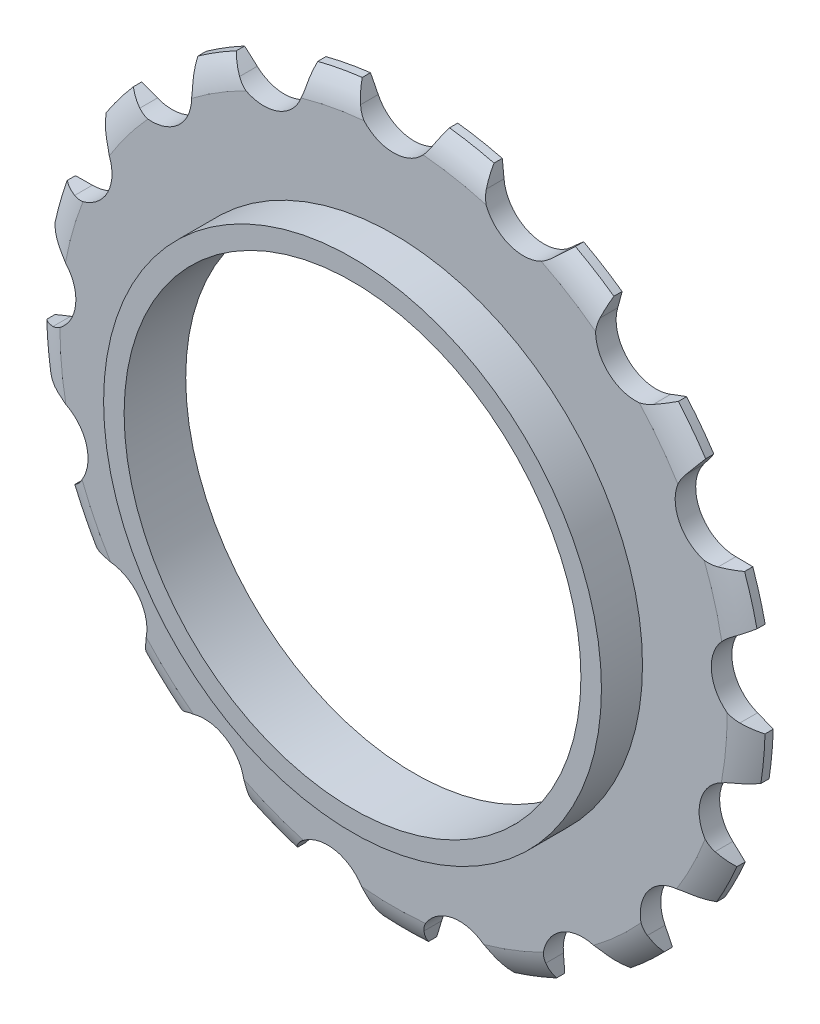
from build123d import *

# Parameters (mm, degrees)
EXTRUDE1_DEPTH      = 50.512018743
CIRPATTERN1_COUNT   = 17
SKETCH4_R           = 24.25
SKETCH4_R_2         = 22.25
EXTRUDE_THIN1_DEPTH = 4


with BuildPart() as part:
    # Sketch2 → Revolve1 (revolve)
    with BuildSketch(Plane(origin=(0, 0, 0), x_dir=(0, 0, -1), z_dir=(1, 0, 0)), mode=Mode.PRIVATE) as revolve1_sk:
        with BuildLine():
            Line((-1.2, 22.25), (0.8, 22.25))
            Line((0.8, 22.25), (0.8, 35))
            Line((0.8, 35), (0, 35))
            ThreePointArc((0, 35), (-0.760147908, 33.826870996), (-1.2, 32.5))
            Line((-1.2, 32.5), (-1.2, 22.25))
        make_face()
    revolve(revolve1_sk.sketch.rotate(Axis((0, 0, -80.9), (0, 0, 1)), 90), axis=Axis((0, 0, -80.9), (0, 0, 1)))

    # Sketch1 → Extrude1 (cut, symmetric)
    with BuildSketch(Plane.XY):
        with BuildLine():
            ThreePointArc((-5.782452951, 37.40569125), (-4.591603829, 35.365989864), (-3.496849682, 33.273140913))
            ThreePointArc((-3.496849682, 33.273140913), (0, 31.1), (3.496849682, 33.273140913))
            ThreePointArc((3.496849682, 33.273140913), (4.591603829, 35.365989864), (5.782452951, 37.40569125))
            ThreePointArc((5.782452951, 37.40569125), (0, 37.85), (-5.782452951, 37.40569125))
        make_face()
    extrude1 = extrude(amount=EXTRUDE1_DEPTH, both=True, mode=Mode.SUBTRACT)

    # CirPattern1: Extrude1 ×17 about axis
    cirpattern1_axis = Axis((0, 0, 0), (0, 0, 1))
    for i in range(1, CIRPATTERN1_COUNT):
        add(extrude1.rotate(cirpattern1_axis, i * 360 / CIRPATTERN1_COUNT), mode=Mode.SUBTRACT)

    # Sketch4 → Extrude-Thin1 (add)
    with BuildSketch(Plane.XY.offset(1.2)):
        Circle(SKETCH4_R)
        Circle(SKETCH4_R_2, mode=Mode.SUBTRACT)
    extrude(amount=EXTRUDE_THIN1_DEPTH)


solid = part.part
